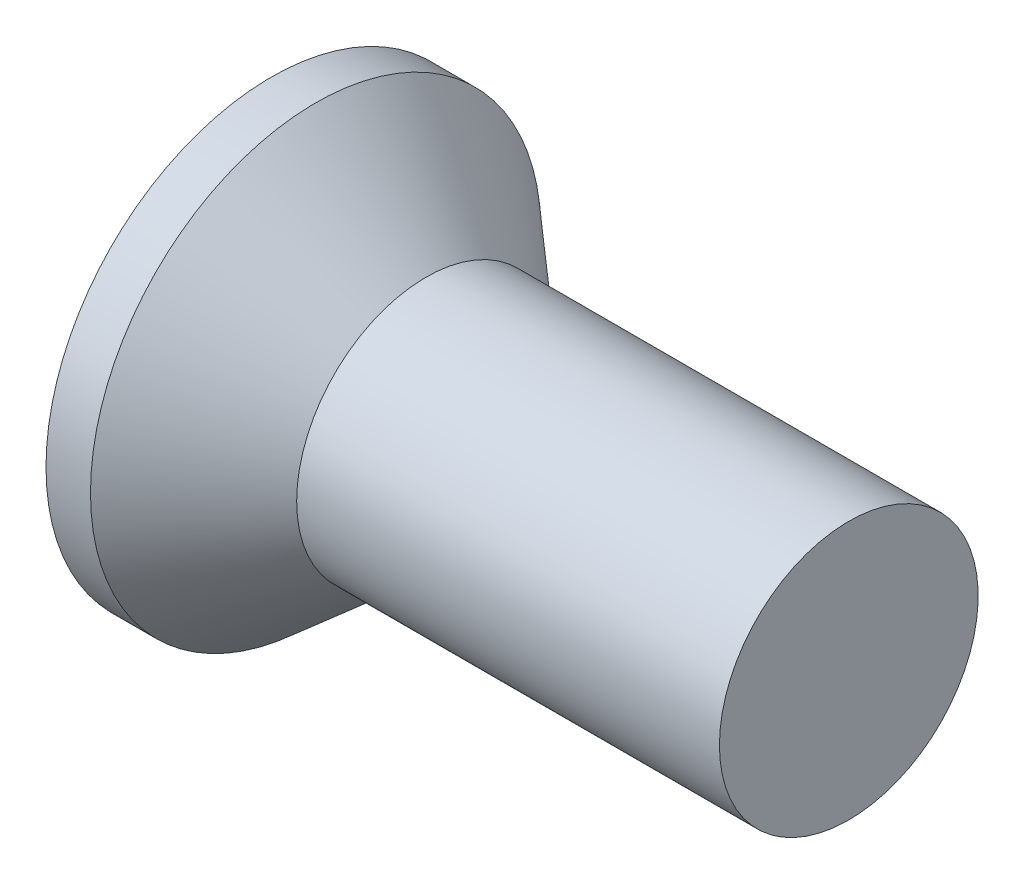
ISO-10303-21;
HEADER;
FILE_DESCRIPTION(('STEP AP214'),'2;1');
FILE_NAME('part.step','',(''),(''),'','','');
FILE_SCHEMA(('AUTOMOTIVE_DESIGN { 1 0 10303 214 1 1 1 1 }'));
ENDSEC;
DATA;
#1=APPLICATION_CONTEXT('core data for automotive mechanical design processes');
#2=APPLICATION_PROTOCOL_DEFINITION('international standard','automotive_design',2000,#1);
#3=PRODUCT_CONTEXT('',#1,'mechanical');
#4=PRODUCT('Part','Part','',(#3));
#5=PRODUCT_RELATED_PRODUCT_CATEGORY('part','',(#4));
#6=PRODUCT_DEFINITION_FORMATION('','',#4);
#7=PRODUCT_DEFINITION_CONTEXT('part definition',#1,'design');
#8=PRODUCT_DEFINITION('design','',#6,#7);
#9=PRODUCT_DEFINITION_SHAPE('','',#8);
#10=(LENGTH_UNIT() NAMED_UNIT(*) SI_UNIT(.MILLI.,.METRE.));
#11=(NAMED_UNIT(*) PLANE_ANGLE_UNIT() SI_UNIT($,.RADIAN.));
#12=(NAMED_UNIT(*) SI_UNIT($,.STERADIAN.) SOLID_ANGLE_UNIT());
#13=UNCERTAINTY_MEASURE_WITH_UNIT(LENGTH_MEASURE(1.E-05),#10,'distance_accuracy_value','');
#14=(GEOMETRIC_REPRESENTATION_CONTEXT(3) GLOBAL_UNCERTAINTY_ASSIGNED_CONTEXT((#13)) GLOBAL_UNIT_ASSIGNED_CONTEXT((#10,
#11,#12)) REPRESENTATION_CONTEXT('',''));
#15=CARTESIAN_POINT('',(0.,0.,0.));
#16=DIRECTION('',(0.,0.,1.));
#17=DIRECTION('',(1.,0.,0.));
#18=AXIS2_PLACEMENT_3D('',#15,#16,#17);
#19=CARTESIAN_POINT('',(0.,0.,0.));
#20=DIRECTION('',(-0.999999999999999,0.,0.));
#21=DIRECTION('',(0.,0.,1.));
#22=AXIS2_PLACEMENT_3D('',#19,#20,#21);
#23=PLANE('',#22);
#24=CARTESIAN_POINT('',(0.,0.,0.));
#25=DIRECTION('',(-0.999999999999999,0.,0.));
#26=DIRECTION('',(0.,0.,1.));
#27=AXIS2_PLACEMENT_3D('',#24,#25,#26);
#28=CIRCLE('',#27,2.4765);
#29=CARTESIAN_POINT('',(0.,0.,2.4765));
#30=VERTEX_POINT('',#29);
#31=EDGE_CURVE('E39',#30,#30,#28,.T.);
#32=ORIENTED_EDGE('',*,*,#31,.T.);
#33=EDGE_LOOP('',(#32));
#34=FACE_BOUND('',#33,.T.);
#35=DIRECTION('',(0.,1.,0.));
#36=VECTOR('',#35,1.);
#37=CARTESIAN_POINT('',(0.,-1.99390000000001,-0.406400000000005));
#38=LINE('',#37,#36);
#39=CARTESIAN_POINT('',(0.,-1.99390000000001,-0.406400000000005));
#40=VERTEX_POINT('',#39);
#41=CARTESIAN_POINT('',(0.,-0.406400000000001,-0.406399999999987));
#42=VERTEX_POINT('',#41);
#43=EDGE_CURVE('E100',#40,#42,#38,.T.);
#44=ORIENTED_EDGE('',*,*,#43,.T.);
#45=DIRECTION('',(0.,0.,-1.));
#46=VECTOR('',#45,1.);
#47=CARTESIAN_POINT('',(0.,-0.406400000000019,1.99389999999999));
#48=LINE('',#47,#46);
#49=CARTESIAN_POINT('',(0.,-0.406399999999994,-1.9939));
#50=VERTEX_POINT('',#49);
#51=EDGE_CURVE('E80',#42,#50,#48,.T.);
#52=ORIENTED_EDGE('',*,*,#51,.T.);
#53=DIRECTION('',(0.,1.,0.));
#54=VECTOR('',#53,1.);
#55=CARTESIAN_POINT('',(0.,-0.406399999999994,-1.9939));
#56=LINE('',#55,#54);
#57=CARTESIAN_POINT('',(0.,0.406400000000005,-1.9939));
#58=VERTEX_POINT('',#57);
#59=EDGE_CURVE('E280',#50,#58,#56,.T.);
#60=ORIENTED_EDGE('',*,*,#59,.T.);
#61=DIRECTION('',(0.,0.,1.));
#62=VECTOR('',#61,1.);
#63=CARTESIAN_POINT('',(0.,0.406400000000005,-1.9939));
#64=LINE('',#63,#62);
#65=CARTESIAN_POINT('',(0.,0.406399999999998,-0.406400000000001));
#66=VERTEX_POINT('',#65);
#67=EDGE_CURVE('E96',#58,#66,#64,.T.);
#68=ORIENTED_EDGE('',*,*,#67,.T.);
#69=CARTESIAN_POINT('',(0.,1.9939,-0.406400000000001));
#70=VERTEX_POINT('',#69);
#71=EDGE_CURVE('E90',#66,#70,#38,.T.);
#72=ORIENTED_EDGE('',*,*,#71,.T.);
#73=DIRECTION('',(0.,0.,1.));
#74=VECTOR('',#73,1.);
#75=CARTESIAN_POINT('',(0.,1.9939,-0.406400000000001));
#76=LINE('',#75,#74);
#77=CARTESIAN_POINT('',(0.,1.99390000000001,0.406399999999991));
#78=VERTEX_POINT('',#77);
#79=EDGE_CURVE('E93',#70,#78,#76,.T.);
#80=ORIENTED_EDGE('',*,*,#79,.T.);
#81=DIRECTION('',(0.,-1.,0.));
#82=VECTOR('',#81,1.);
#83=CARTESIAN_POINT('',(0.,1.99390000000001,0.406399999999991));
#84=LINE('',#83,#82);
#85=CARTESIAN_POINT('',(0.,0.406399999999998,0.406400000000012));
#86=VERTEX_POINT('',#85);
#87=EDGE_CURVE('E292',#78,#86,#84,.T.);
#88=ORIENTED_EDGE('',*,*,#87,.T.);
#89=CARTESIAN_POINT('',(0.,0.40639999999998,1.99390000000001));
#90=VERTEX_POINT('',#89);
#91=EDGE_CURVE('E275',#86,#90,#64,.T.);
#92=ORIENTED_EDGE('',*,*,#91,.T.);
#93=DIRECTION('',(0.,-1.,0.));
#94=VECTOR('',#93,1.);
#95=CARTESIAN_POINT('',(0.,0.40639999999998,1.99390000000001));
#96=LINE('',#95,#94);
#97=CARTESIAN_POINT('',(0.,-0.406400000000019,1.99389999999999));
#98=VERTEX_POINT('',#97);
#99=EDGE_CURVE('E261',#90,#98,#96,.T.);
#100=ORIENTED_EDGE('',*,*,#99,.T.);
#101=CARTESIAN_POINT('',(0.,-0.406400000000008,0.406400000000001));
#102=VERTEX_POINT('',#101);
#103=EDGE_CURVE('E273',#98,#102,#48,.T.);
#104=ORIENTED_EDGE('',*,*,#103,.T.);
#105=CARTESIAN_POINT('',(0.,-1.99390000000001,0.406399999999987));
#106=VERTEX_POINT('',#105);
#107=EDGE_CURVE('E106',#102,#106,#84,.T.);
#108=ORIENTED_EDGE('',*,*,#107,.T.);
#109=DIRECTION('',(0.,0.,-1.));
#110=VECTOR('',#109,1.);
#111=CARTESIAN_POINT('',(0.,-1.99390000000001,0.406399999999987));
#112=LINE('',#111,#110);
#113=EDGE_CURVE('E129',#106,#40,#112,.T.);
#114=ORIENTED_EDGE('',*,*,#113,.T.);
#115=EDGE_LOOP('',(#44,#52,#60,#68,#72,#80,#88,#92,#100,#104,#108,#114));
#116=FACE_BOUND('',#115,.T.);
#117=ADVANCED_FACE('F32',(#34,#116),#23,.T.);
#118=CARTESIAN_POINT('',(2.48883971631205,0.,0.18014184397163));
#119=DIRECTION('',(-0.0905357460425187,0.,-0.995893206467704));
#120=DIRECTION('',(-0.995893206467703,0.,0.0905357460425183));
#121=AXIS2_PLACEMENT_3D('',#118,#119,#120);
#122=PLANE('',#121);
#123=ORIENTED_EDGE('',*,*,#107,.F.);
#124=DIRECTION('',(0.991836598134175,0.0901669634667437,-0.090166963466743));
#125=VECTOR('',#124,1.);
#126=CARTESIAN_POINT('',(2.5049499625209,-0.178677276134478,0.178677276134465));
#127=LINE('',#126,#125);
#128=CARTESIAN_POINT('',(2.2352,-0.203200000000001,0.203199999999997));
#129=VERTEX_POINT('',#128);
#130=EDGE_CURVE('E124',#102,#129,#127,.T.);
#131=ORIENTED_EDGE('',*,*,#130,.T.);
#132=DIRECTION('',(0.778479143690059,0.623667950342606,-0.0707708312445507));
#133=VECTOR('',#132,1.);
#134=CARTESIAN_POINT('',(0.,-1.99390000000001,0.406399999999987));
#135=LINE('',#134,#133);
#136=EDGE_CURVE('E101',#106,#129,#135,.T.);
#137=ORIENTED_EDGE('',*,*,#136,.F.);
#138=EDGE_LOOP('',(#123,#131,#137));
#139=FACE_BOUND('',#138,.T.);
#140=ADVANCED_FACE('F152',(#139),#122,.T.);
#141=DIRECTION('',(0.778479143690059,-0.623667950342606,-0.0707708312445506));
#142=VECTOR('',#141,1.);
#143=CARTESIAN_POINT('',(0.,1.99390000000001,0.406399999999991));
#144=LINE('',#143,#142);
#145=CARTESIAN_POINT('',(2.2352,0.203199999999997,0.203200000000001));
#146=VERTEX_POINT('',#145);
#147=EDGE_CURVE('E46',#78,#146,#144,.T.);
#148=ORIENTED_EDGE('',*,*,#147,.T.);
#149=DIRECTION('',(-0.991836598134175,0.090166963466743,0.090166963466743));
#150=VECTOR('',#149,1.);
#151=CARTESIAN_POINT('',(2.5049499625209,0.178677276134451,0.178677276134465));
#152=LINE('',#151,#150);
#153=EDGE_CURVE('E288',#146,#86,#152,.T.);
#154=ORIENTED_EDGE('',*,*,#153,.T.);
#155=ORIENTED_EDGE('',*,*,#87,.F.);
#156=EDGE_LOOP('',(#148,#154,#155));
#157=FACE_BOUND('',#156,.T.);
#158=ADVANCED_FACE('F156',(#157),#122,.T.);
#159=CARTESIAN_POINT('',(2.48883971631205,0.,-0.18014184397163));
#160=DIRECTION('',(-0.0905357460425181,0.,0.995893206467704));
#161=DIRECTION('',(0.995893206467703,0.,0.0905357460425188));
#162=AXIS2_PLACEMENT_3D('',#159,#160,#161);
#163=PLANE('',#162);
#164=DIRECTION('',(0.778479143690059,0.623667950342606,0.0707708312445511));
#165=VECTOR('',#164,1.);
#166=CARTESIAN_POINT('',(0.,-1.99390000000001,-0.406400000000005));
#167=LINE('',#166,#165);
#168=CARTESIAN_POINT('',(2.2352,-0.203200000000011,-0.203200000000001));
#169=VERTEX_POINT('',#168);
#170=EDGE_CURVE('E55',#40,#169,#167,.T.);
#171=ORIENTED_EDGE('',*,*,#170,.T.);
#172=DIRECTION('',(-0.991836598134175,-0.0901669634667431,-0.0901669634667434));
#173=VECTOR('',#172,1.);
#174=CARTESIAN_POINT('',(2.5049499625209,-0.178677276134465,-0.178677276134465));
#175=LINE('',#174,#173);
#176=EDGE_CURVE('E11',#169,#42,#175,.T.);
#177=ORIENTED_EDGE('',*,*,#176,.T.);
#178=ORIENTED_EDGE('',*,*,#43,.F.);
#179=EDGE_LOOP('',(#171,#177,#178));
#180=FACE_BOUND('',#179,.T.);
#181=ADVANCED_FACE('F149',(#180),#163,.T.);
#182=ORIENTED_EDGE('',*,*,#71,.F.);
#183=DIRECTION('',(0.991836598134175,-0.0901669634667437,0.0901669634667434));
#184=VECTOR('',#183,1.);
#185=CARTESIAN_POINT('',(2.5049499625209,0.178677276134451,-0.178677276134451));
#186=LINE('',#185,#184);
#187=CARTESIAN_POINT('',(2.2352,0.203200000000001,-0.203200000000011));
#188=VERTEX_POINT('',#187);
#189=EDGE_CURVE('E109',#66,#188,#186,.T.);
#190=ORIENTED_EDGE('',*,*,#189,.T.);
#191=DIRECTION('',(0.778479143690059,-0.623667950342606,0.0707708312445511));
#192=VECTOR('',#191,1.);
#193=CARTESIAN_POINT('',(0.,1.9939,-0.406400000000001));
#194=LINE('',#193,#192);
#195=EDGE_CURVE('E105',#70,#188,#194,.T.);
#196=ORIENTED_EDGE('',*,*,#195,.F.);
#197=EDGE_LOOP('',(#182,#190,#196));
#198=FACE_BOUND('',#197,.T.);
#199=ADVANCED_FACE('F108',(#198),#163,.T.);
#200=CARTESIAN_POINT('',(-6.34999999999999,0.,0.));
#201=DIRECTION('',(-0.999999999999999,0.,0.));
#202=DIRECTION('',(0.,0.,1.));
#203=AXIS2_PLACEMENT_3D('',#200,#201,#202);
#204=CYLINDRICAL_SURFACE('',#203,2.4765);
#205=CARTESIAN_POINT('',(0.489196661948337,0.,0.));
#206=DIRECTION('',(-0.999999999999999,0.,0.));
#207=DIRECTION('',(0.,0.,1.));
#208=AXIS2_PLACEMENT_3D('',#205,#206,#207);
#209=CIRCLE('',#208,2.4765);
#210=CARTESIAN_POINT('',(0.489196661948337,0.,2.4765));
#211=VERTEX_POINT('',#210);
#212=EDGE_CURVE('E132',#211,#211,#209,.T.);
#213=CARTESIAN_POINT('',(0.489196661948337,0.,2.4765));
#214=CARTESIAN_POINT('',(0.484100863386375,0.,2.4765));
#215=CARTESIAN_POINT('',(0.479005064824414,0.,2.4765));
#216=CARTESIAN_POINT('',(0.46881346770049,0.,2.4765));
#217=CARTESIAN_POINT('',(0.463717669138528,0.,2.4765));
#218=CARTESIAN_POINT('',(0.453526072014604,0.,2.4765));
#219=CARTESIAN_POINT('',(0.448430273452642,0.,2.4765));
#220=CARTESIAN_POINT('',(0.438238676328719,0.,2.4765));
#221=CARTESIAN_POINT('',(0.433142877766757,0.,2.4765));
#222=CARTESIAN_POINT('',(0.422951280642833,0.,2.4765));
#223=CARTESIAN_POINT('',(0.417855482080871,0.,2.4765));
#224=CARTESIAN_POINT('',(0.407663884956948,0.,2.4765));
#225=CARTESIAN_POINT('',(0.402568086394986,0.,2.4765));
#226=CARTESIAN_POINT('',(0.392376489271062,0.,2.4765));
#227=CARTESIAN_POINT('',(0.3872806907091,0.,2.4765));
#228=CARTESIAN_POINT('',(0.377089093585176,0.,2.4765));
#229=CARTESIAN_POINT('',(0.371993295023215,0.,2.4765));
#230=CARTESIAN_POINT('',(0.361801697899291,0.,2.4765));
#231=CARTESIAN_POINT('',(0.356705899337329,0.,2.4765));
#232=CARTESIAN_POINT('',(0.346514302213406,0.,2.4765));
#233=CARTESIAN_POINT('',(0.341418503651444,0.,2.4765));
#234=CARTESIAN_POINT('',(0.33122690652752,0.,2.4765));
#235=CARTESIAN_POINT('',(0.326131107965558,0.,2.4765));
#236=CARTESIAN_POINT('',(0.315939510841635,0.,2.4765));
#237=CARTESIAN_POINT('',(0.310843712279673,0.,2.4765));
#238=CARTESIAN_POINT('',(0.300652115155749,0.,2.4765));
#239=CARTESIAN_POINT('',(0.295556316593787,0.,2.4765));
#240=CARTESIAN_POINT('',(0.285364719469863,0.,2.4765));
#241=CARTESIAN_POINT('',(0.280268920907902,0.,2.4765));
#242=CARTESIAN_POINT('',(0.270077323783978,0.,2.4765));
#243=CARTESIAN_POINT('',(0.264981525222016,0.,2.4765));
#244=CARTESIAN_POINT('',(0.254789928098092,0.,2.4765));
#245=CARTESIAN_POINT('',(0.24969412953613,0.,2.4765));
#246=CARTESIAN_POINT('',(0.239502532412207,0.,2.4765));
#247=CARTESIAN_POINT('',(0.234406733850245,0.,2.4765));
#248=CARTESIAN_POINT('',(0.224215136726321,0.,2.4765));
#249=CARTESIAN_POINT('',(0.219119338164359,0.,2.4765));
#250=CARTESIAN_POINT('',(0.208927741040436,0.,2.4765));
#251=CARTESIAN_POINT('',(0.203831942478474,0.,2.4765));
#252=CARTESIAN_POINT('',(0.19364034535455,0.,2.4765));
#253=CARTESIAN_POINT('',(0.188544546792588,0.,2.4765));
#254=CARTESIAN_POINT('',(0.178352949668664,0.,2.4765));
#255=CARTESIAN_POINT('',(0.173257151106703,0.,2.4765));
#256=CARTESIAN_POINT('',(0.163065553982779,0.,2.4765));
#257=CARTESIAN_POINT('',(0.157969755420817,0.,2.4765));
#258=CARTESIAN_POINT('',(0.147778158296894,0.,2.4765));
#259=CARTESIAN_POINT('',(0.142682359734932,0.,2.4765));
#260=CARTESIAN_POINT('',(0.132490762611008,0.,2.4765));
#261=CARTESIAN_POINT('',(0.127394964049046,0.,2.4765));
#262=CARTESIAN_POINT('',(0.117203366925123,0.,2.4765));
#263=CARTESIAN_POINT('',(0.112107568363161,0.,2.4765));
#264=CARTESIAN_POINT('',(0.101915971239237,0.,2.4765));
#265=CARTESIAN_POINT('',(0.096820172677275,0.,2.4765));
#266=CARTESIAN_POINT('',(0.0866285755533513,0.,2.4765));
#267=CARTESIAN_POINT('',(0.0815327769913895,0.,2.4765));
#268=CARTESIAN_POINT('',(0.0713411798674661,0.,2.4765));
#269=CARTESIAN_POINT('',(0.0662453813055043,0.,2.4765));
#270=CARTESIAN_POINT('',(0.0560537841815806,0.,2.4765));
#271=CARTESIAN_POINT('',(0.0509579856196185,0.,2.4765));
#272=CARTESIAN_POINT('',(0.0407663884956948,0.,2.4765));
#273=CARTESIAN_POINT('',(0.035670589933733,0.,2.4765));
#274=CARTESIAN_POINT('',(0.0254789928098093,0.,2.4765));
#275=CARTESIAN_POINT('',(0.0203831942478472,0.,2.4765));
#276=CARTESIAN_POINT('',(0.0101915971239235,0.,2.4765));
#277=CARTESIAN_POINT('',(0.00509579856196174,0.,2.4765));
#278=CARTESIAN_POINT('',(0.,0.,2.4765));
#279=B_SPLINE_CURVE_WITH_KNOTS('',3,(#213,#214,#215,#216,#217,#218,#219,#220,#221,#222,#223,
#224,#225,#226,#227,#228,#229,#230,#231,#232,#233,#234,#235,#236,#237,#238,#239,#240,#241,#242,
#243,#244,#245,#246,#247,#248,#249,#250,#251,#252,#253,#254,#255,#256,#257,#258,#259,#260,#261,
#262,#263,#264,#265,#266,#267,#268,#269,#270,#271,#272,#273,#274,#275,#276,#277,#278),
.UNSPECIFIED.,.F.,.F.,(4,2,2,2,2,2,2,2,2,2,2,2,2,2,2,2,2,2,2,2,2,2,2,2,2,2,2,2,2,2,2,2,4),(0.,
0.0152873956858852,0.0305747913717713,0.0458621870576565,0.0611495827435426,0.0764369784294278,
0.091724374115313,0.107011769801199,0.122299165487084,0.13758656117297,0.152873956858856,
0.168161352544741,0.183448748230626,0.198736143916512,0.214023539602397,0.229310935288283,
0.244598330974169,0.259885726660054,0.27517312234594,0.290460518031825,0.305747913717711,
0.321035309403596,0.336322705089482,0.351610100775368,0.366897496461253,0.382184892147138,
0.397472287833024,0.412759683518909,0.428047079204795,0.443334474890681,0.458621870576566,
0.473909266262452,0.489196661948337),.UNSPECIFIED.);
#280=EDGE_CURVE('BSEAM138',#211,#30,#279,.T.);
#281=ORIENTED_EDGE('',*,*,#212,.T.);
#282=ORIENTED_EDGE('',*,*,#31,.F.);
#283=ORIENTED_EDGE('',*,*,#280,.T.);
#284=ORIENTED_EDGE('',*,*,#280,.F.);
#285=EDGE_LOOP('',(#281,#283,#282,#284));
#286=FACE_BOUND('',#285,.T.);
#287=ADVANCED_FACE('F138',(#286),#204,.T.);
#288=CARTESIAN_POINT('',(0.489196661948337,0.,0.));
#289=DIRECTION('',(-0.999999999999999,0.,0.));
#290=DIRECTION('',(0.,0.,1.));
#291=AXIS2_PLACEMENT_3D('',#288,#289,#290);
#292=CONICAL_SURFACE('',#291,2.4765,0.715584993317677);
#293=CARTESIAN_POINT('',(1.7018,0.,0.));
#294=DIRECTION('',(-0.999999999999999,0.,0.));
#295=DIRECTION('',(0.,0.,1.));
#296=AXIS2_PLACEMENT_3D('',#293,#294,#295);
#297=CIRCLE('',#296,1.4224);
#298=CARTESIAN_POINT('',(1.7018,0.,1.4224));
#299=VERTEX_POINT('',#298);
#300=EDGE_CURVE('E128',#299,#299,#297,.T.);
#301=CARTESIAN_POINT('',(1.7018,0.,1.4224));
#302=CARTESIAN_POINT('',(1.68916871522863,0.,1.43338020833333));
#303=CARTESIAN_POINT('',(1.67653743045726,0.,1.44436041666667));
#304=CARTESIAN_POINT('',(1.65127486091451,0.,1.46632083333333));
#305=CARTESIAN_POINT('',(1.63864357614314,0.,1.47730104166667));
#306=CARTESIAN_POINT('',(1.6133810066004,0.,1.49926145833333));
#307=CARTESIAN_POINT('',(1.60074972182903,0.,1.51024166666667));
#308=CARTESIAN_POINT('',(1.57548715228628,0.,1.53220208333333));
#309=CARTESIAN_POINT('',(1.56285586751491,0.,1.54318229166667));
#310=CARTESIAN_POINT('',(1.53759329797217,0.,1.56514270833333));
#311=CARTESIAN_POINT('',(1.5249620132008,0.,1.57612291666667));
#312=CARTESIAN_POINT('',(1.49969944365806,0.,1.59808333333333));
#313=CARTESIAN_POINT('',(1.48706815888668,0.,1.60906354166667));
#314=CARTESIAN_POINT('',(1.46180558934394,0.,1.63102395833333));
#315=CARTESIAN_POINT('',(1.44917430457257,0.,1.64200416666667));
#316=CARTESIAN_POINT('',(1.42391173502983,0.,1.66396458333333));
#317=CARTESIAN_POINT('',(1.41128045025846,0.,1.67494479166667));
#318=CARTESIAN_POINT('',(1.38601788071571,0.,1.69690520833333));
#319=CARTESIAN_POINT('',(1.37338659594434,0.,1.70788541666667));
#320=CARTESIAN_POINT('',(1.3481240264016,0.,1.72984583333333));
#321=CARTESIAN_POINT('',(1.33549274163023,0.,1.74082604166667));
#322=CARTESIAN_POINT('',(1.31023017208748,0.,1.76278645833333));
#323=CARTESIAN_POINT('',(1.29759888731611,0.,1.77376666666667));
#324=CARTESIAN_POINT('',(1.27233631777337,0.,1.79572708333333));
#325=CARTESIAN_POINT('',(1.259705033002,0.,1.80670729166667));
#326=CARTESIAN_POINT('',(1.23444246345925,0.,1.82866770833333));
#327=CARTESIAN_POINT('',(1.22181117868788,0.,1.83964791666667));
#328=CARTESIAN_POINT('',(1.19654860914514,0.,1.86160833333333));
#329=CARTESIAN_POINT('',(1.18391732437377,0.,1.87258854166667));
#330=CARTESIAN_POINT('',(1.15865475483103,0.,1.89454895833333));
#331=CARTESIAN_POINT('',(1.14602347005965,0.,1.90552916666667));
#332=CARTESIAN_POINT('',(1.12076090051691,0.,1.92748958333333));
#333=CARTESIAN_POINT('',(1.10812961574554,0.,1.93846979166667));
#334=CARTESIAN_POINT('',(1.0828670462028,0.,1.96043020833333));
#335=CARTESIAN_POINT('',(1.07023576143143,0.,1.97141041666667));
#336=CARTESIAN_POINT('',(1.04497319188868,0.,1.99337083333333));
#337=CARTESIAN_POINT('',(1.03234190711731,0.,2.00435104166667));
#338=CARTESIAN_POINT('',(1.00707933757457,0.,2.02631145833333));
#339=CARTESIAN_POINT('',(0.994448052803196,0.,2.03729166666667));
#340=CARTESIAN_POINT('',(0.969185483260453,0.,2.05925208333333));
#341=CARTESIAN_POINT('',(0.956554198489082,0.,2.07023229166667));
#342=CARTESIAN_POINT('',(0.931291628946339,0.,2.09219270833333));
#343=CARTESIAN_POINT('',(0.918660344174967,0.,2.10317291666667));
#344=CARTESIAN_POINT('',(0.893397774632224,0.,2.12513333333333));
#345=CARTESIAN_POINT('',(0.880766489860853,0.,2.13611354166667));
#346=CARTESIAN_POINT('',(0.85550392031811,0.,2.15807395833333));
#347=CARTESIAN_POINT('',(0.842872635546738,0.,2.16905416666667));
#348=CARTESIAN_POINT('',(0.817610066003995,0.,2.19101458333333));
#349=CARTESIAN_POINT('',(0.804978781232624,0.,2.20199479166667));
#350=CARTESIAN_POINT('',(0.779716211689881,0.,2.22395520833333));
#351=CARTESIAN_POINT('',(0.767084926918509,0.,2.23493541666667));
#352=CARTESIAN_POINT('',(0.741822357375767,0.,2.25689583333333));
#353=CARTESIAN_POINT('',(0.729191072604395,0.,2.26787604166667));
#354=CARTESIAN_POINT('',(0.703928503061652,0.,2.28983645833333));
#355=CARTESIAN_POINT('',(0.69129721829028,0.,2.30081666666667));
#356=CARTESIAN_POINT('',(0.666034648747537,0.,2.32277708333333));
#357=CARTESIAN_POINT('',(0.653403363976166,0.,2.33375729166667));
#358=CARTESIAN_POINT('',(0.628140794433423,0.,2.35571770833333));
#359=CARTESIAN_POINT('',(0.615509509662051,0.,2.36669791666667));
#360=CARTESIAN_POINT('',(0.590246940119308,0.,2.38865833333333));
#361=CARTESIAN_POINT('',(0.577615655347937,0.,2.39963854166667));
#362=CARTESIAN_POINT('',(0.552353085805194,0.,2.42159895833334));
#363=CARTESIAN_POINT('',(0.539721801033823,0.,2.43257916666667));
#364=CARTESIAN_POINT('',(0.51445923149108,0.,2.45453958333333));
#365=CARTESIAN_POINT('',(0.501827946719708,0.,2.46551979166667));
#366=CARTESIAN_POINT('',(0.489196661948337,0.,2.4765));
#367=B_SPLINE_CURVE_WITH_KNOTS('',3,(#301,#302,#303,#304,#305,#306,#307,#308,#309,#310,#311,
#312,#313,#314,#315,#316,#317,#318,#319,#320,#321,#322,#323,#324,#325,#326,#327,#328,#329,#330,
#331,#332,#333,#334,#335,#336,#337,#338,#339,#340,#341,#342,#343,#344,#345,#346,#347,#348,#349,
#350,#351,#352,#353,#354,#355,#356,#357,#358,#359,#360,#361,#362,#363,#364,#365,#366),
.UNSPECIFIED.,.F.,.F.,(4,2,2,2,2,2,2,2,2,2,2,2,2,2,2,2,2,2,2,2,2,2,2,2,2,2,2,2,2,2,2,2,4),(0.,
0.0502098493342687,0.100419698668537,0.150629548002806,0.200839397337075,0.251049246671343,
0.301259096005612,0.351468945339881,0.40167879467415,0.451888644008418,0.502098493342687,
0.552308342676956,0.602518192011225,0.652728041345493,0.702937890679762,0.753147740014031,
0.803357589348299,0.853567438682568,0.903777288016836,0.953987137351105,1.00419698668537,
1.05440683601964,1.10461668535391,1.15482653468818,1.20503638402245,1.25524623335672,
1.30545608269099,1.35566593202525,1.40587578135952,1.45608563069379,1.50629548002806,
1.55650532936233,1.6067151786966),.UNSPECIFIED.);
#368=EDGE_CURVE('BSEAM140',#299,#211,#367,.T.);
#369=ORIENTED_EDGE('',*,*,#300,.T.);
#370=ORIENTED_EDGE('',*,*,#212,.F.);
#371=ORIENTED_EDGE('',*,*,#368,.T.);
#372=ORIENTED_EDGE('',*,*,#368,.F.);
#373=EDGE_LOOP('',(#369,#371,#370,#372));
#374=FACE_BOUND('',#373,.T.);
#375=ADVANCED_FACE('F140',(#374),#292,.T.);
#376=CARTESIAN_POINT('',(-6.34999999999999,0.,0.));
#377=DIRECTION('',(-0.999999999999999,0.,0.));
#378=DIRECTION('',(0.,0.,1.));
#379=AXIS2_PLACEMENT_3D('',#376,#377,#378);
#380=CYLINDRICAL_SURFACE('',#379,1.4224);
#381=CARTESIAN_POINT('',(6.34999999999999,0.,0.));
#382=DIRECTION('',(-0.999999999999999,0.,0.));
#383=DIRECTION('',(0.,0.,1.));
#384=AXIS2_PLACEMENT_3D('',#381,#382,#383);
#385=CIRCLE('',#384,1.4224);
#386=CARTESIAN_POINT('',(6.34999999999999,0.,1.4224));
#387=VERTEX_POINT('',#386);
#388=EDGE_CURVE('E125',#387,#387,#385,.T.);
#389=CARTESIAN_POINT('',(6.34999999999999,0.,1.4224));
#390=CARTESIAN_POINT('',(6.30158124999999,0.,1.4224));
#391=CARTESIAN_POINT('',(6.25316249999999,0.,1.4224));
#392=CARTESIAN_POINT('',(6.15632499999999,0.,1.4224));
#393=CARTESIAN_POINT('',(6.10790624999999,0.,1.4224));
#394=CARTESIAN_POINT('',(6.01106874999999,0.,1.4224));
#395=CARTESIAN_POINT('',(5.96264999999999,0.,1.4224));
#396=CARTESIAN_POINT('',(5.86581249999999,0.,1.4224));
#397=CARTESIAN_POINT('',(5.81739374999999,0.,1.4224));
#398=CARTESIAN_POINT('',(5.72055624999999,0.,1.4224));
#399=CARTESIAN_POINT('',(5.67213749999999,0.,1.4224));
#400=CARTESIAN_POINT('',(5.57529999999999,0.,1.4224));
#401=CARTESIAN_POINT('',(5.52688124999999,0.,1.4224));
#402=CARTESIAN_POINT('',(5.43004374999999,0.,1.4224));
#403=CARTESIAN_POINT('',(5.38162499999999,0.,1.4224));
#404=CARTESIAN_POINT('',(5.28478749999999,0.,1.4224));
#405=CARTESIAN_POINT('',(5.23636874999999,0.,1.4224));
#406=CARTESIAN_POINT('',(5.13953124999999,0.,1.4224));
#407=CARTESIAN_POINT('',(5.09111249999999,0.,1.4224));
#408=CARTESIAN_POINT('',(4.99427499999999,0.,1.4224));
#409=CARTESIAN_POINT('',(4.94585624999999,0.,1.4224));
#410=CARTESIAN_POINT('',(4.84901874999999,0.,1.4224));
#411=CARTESIAN_POINT('',(4.80059999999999,0.,1.4224));
#412=CARTESIAN_POINT('',(4.70376249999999,0.,1.4224));
#413=CARTESIAN_POINT('',(4.65534374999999,0.,1.4224));
#414=CARTESIAN_POINT('',(4.55850624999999,0.,1.4224));
#415=CARTESIAN_POINT('',(4.51008749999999,0.,1.4224));
#416=CARTESIAN_POINT('',(4.41324999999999,0.,1.4224));
#417=CARTESIAN_POINT('',(4.36483124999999,0.,1.4224));
#418=CARTESIAN_POINT('',(4.26799374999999,0.,1.4224));
#419=CARTESIAN_POINT('',(4.21957499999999,0.,1.4224));
#420=CARTESIAN_POINT('',(4.12273749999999,0.,1.4224));
#421=CARTESIAN_POINT('',(4.07431874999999,0.,1.4224));
#422=CARTESIAN_POINT('',(3.97748124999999,0.,1.4224));
#423=CARTESIAN_POINT('',(3.92906249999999,0.,1.4224));
#424=CARTESIAN_POINT('',(3.83222499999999,0.,1.4224));
#425=CARTESIAN_POINT('',(3.78380624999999,0.,1.4224));
#426=CARTESIAN_POINT('',(3.68696874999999,0.,1.4224));
#427=CARTESIAN_POINT('',(3.63854999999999,0.,1.4224));
#428=CARTESIAN_POINT('',(3.54171249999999,0.,1.4224));
#429=CARTESIAN_POINT('',(3.49329374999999,0.,1.4224));
#430=CARTESIAN_POINT('',(3.39645625,0.,1.4224));
#431=CARTESIAN_POINT('',(3.34803749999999,0.,1.4224));
#432=CARTESIAN_POINT('',(3.2512,0.,1.4224));
#433=CARTESIAN_POINT('',(3.20278125,0.,1.4224));
#434=CARTESIAN_POINT('',(3.10594375,0.,1.4224));
#435=CARTESIAN_POINT('',(3.057525,0.,1.4224));
#436=CARTESIAN_POINT('',(2.9606875,0.,1.4224));
#437=CARTESIAN_POINT('',(2.91226875,0.,1.4224));
#438=CARTESIAN_POINT('',(2.81543125,0.,1.4224));
#439=CARTESIAN_POINT('',(2.7670125,0.,1.4224));
#440=CARTESIAN_POINT('',(2.670175,0.,1.4224));
#441=CARTESIAN_POINT('',(2.62175625,0.,1.4224));
#442=CARTESIAN_POINT('',(2.52491875,0.,1.4224));
#443=CARTESIAN_POINT('',(2.4765,0.,1.4224));
#444=CARTESIAN_POINT('',(2.3796625,0.,1.4224));
#445=CARTESIAN_POINT('',(2.33124375,0.,1.4224));
#446=CARTESIAN_POINT('',(2.23440625,0.,1.4224));
#447=CARTESIAN_POINT('',(2.1859875,0.,1.4224));
#448=CARTESIAN_POINT('',(2.08915,0.,1.4224));
#449=CARTESIAN_POINT('',(2.04073125,0.,1.4224));
#450=CARTESIAN_POINT('',(1.94389375,0.,1.4224));
#451=CARTESIAN_POINT('',(1.895475,0.,1.4224));
#452=CARTESIAN_POINT('',(1.7986375,0.,1.4224));
#453=CARTESIAN_POINT('',(1.75021875,0.,1.4224));
#454=CARTESIAN_POINT('',(1.7018,0.,1.4224));
#455=B_SPLINE_CURVE_WITH_KNOTS('',3,(#389,#390,#391,#392,#393,#394,#395,#396,#397,#398,#399,
#400,#401,#402,#403,#404,#405,#406,#407,#408,#409,#410,#411,#412,#413,#414,#415,#416,#417,#418,
#419,#420,#421,#422,#423,#424,#425,#426,#427,#428,#429,#430,#431,#432,#433,#434,#435,#436,#437,
#438,#439,#440,#441,#442,#443,#444,#445,#446,#447,#448,#449,#450,#451,#452,#453,#454),
.UNSPECIFIED.,.F.,.F.,(4,2,2,2,2,2,2,2,2,2,2,2,2,2,2,2,2,2,2,2,2,2,2,2,2,2,2,2,2,2,2,2,4),(0.,
0.145256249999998,0.290512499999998,0.435768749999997,0.581024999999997,0.726281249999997,
0.871537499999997,1.01679375,1.16205,1.30730625,1.4525625,1.59781875,1.743075,1.88833124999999,
2.03358749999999,2.17884374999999,2.32409999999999,2.46935624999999,2.61461249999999,
2.75986874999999,2.90512499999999,3.05038124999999,3.19563749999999,3.34089374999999,
3.48614999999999,3.63140624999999,3.77666249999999,3.92191874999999,4.06717499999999,
4.21243124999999,4.35768749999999,4.50294374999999,4.64819999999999),.UNSPECIFIED.);
#456=EDGE_CURVE('BSEAM146',#387,#299,#455,.T.);
#457=ORIENTED_EDGE('',*,*,#388,.T.);
#458=ORIENTED_EDGE('',*,*,#300,.F.);
#459=ORIENTED_EDGE('',*,*,#456,.T.);
#460=ORIENTED_EDGE('',*,*,#456,.F.);
#461=EDGE_LOOP('',(#457,#459,#458,#460));
#462=FACE_BOUND('',#461,.T.);
#463=ADVANCED_FACE('F146',(#462),#380,.T.);
#464=CARTESIAN_POINT('',(6.34999999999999,1.42239999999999,0.));
#465=DIRECTION('',(0.999999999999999,0.,0.));
#466=DIRECTION('',(0.,0.,-1.));
#467=AXIS2_PLACEMENT_3D('',#464,#465,#466);
#468=PLANE('',#467);
#469=ORIENTED_EDGE('',*,*,#388,.F.);
#470=EDGE_LOOP('',(#469));
#471=FACE_BOUND('',#470,.T.);
#472=ADVANCED_FACE('F176',(#471),#468,.T.);
#473=CARTESIAN_POINT('',(2.2352,0.203200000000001,-0.203200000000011));
#474=DIRECTION('',(0.999999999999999,0.,0.));
#475=DIRECTION('',(0.,0.,-1.));
#476=AXIS2_PLACEMENT_3D('',#473,#474,#475);
#477=PLANE('',#476);
#478=DIRECTION('',(0.,1.,0.));
#479=VECTOR('',#478,1.);
#480=CARTESIAN_POINT('',(2.2352,-0.203200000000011,-0.203200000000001));
#481=LINE('',#480,#479);
#482=EDGE_CURVE('E120',#169,#188,#481,.T.);
#483=ORIENTED_EDGE('',*,*,#482,.F.);
#484=DIRECTION('',(0.,0.,-1.));
#485=VECTOR('',#484,1.);
#486=CARTESIAN_POINT('',(2.2352,-0.203200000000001,0.203199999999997));
#487=LINE('',#486,#485);
#488=EDGE_CURVE('E111',#129,#169,#487,.T.);
#489=ORIENTED_EDGE('',*,*,#488,.F.);
#490=DIRECTION('',(0.,-1.,0.));
#491=VECTOR('',#490,1.);
#492=CARTESIAN_POINT('',(2.2352,0.203199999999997,0.203200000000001));
#493=LINE('',#492,#491);
#494=EDGE_CURVE('E114',#146,#129,#493,.T.);
#495=ORIENTED_EDGE('',*,*,#494,.F.);
#496=DIRECTION('',(0.,0.,1.));
#497=VECTOR('',#496,1.);
#498=CARTESIAN_POINT('',(2.2352,0.203200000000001,-0.203200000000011));
#499=LINE('',#498,#497);
#500=EDGE_CURVE('E118',#188,#146,#499,.T.);
#501=ORIENTED_EDGE('',*,*,#500,.F.);
#502=EDGE_LOOP('',(#483,#489,#495,#501));
#503=FACE_BOUND('',#502,.T.);
#504=ADVANCED_FACE('F173',(#503),#477,.F.);
#505=CARTESIAN_POINT('',(0.,-1.99390000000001,-0.406400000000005));
#506=DIRECTION('',(-0.625235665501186,0.780436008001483,0.));
#507=DIRECTION('',(-0.78043600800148,-0.625235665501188,0.));
#508=AXIS2_PLACEMENT_3D('',#505,#506,#507);
#509=PLANE('',#508);
#510=ORIENTED_EDGE('',*,*,#170,.F.);
#511=ORIENTED_EDGE('',*,*,#113,.F.);
#512=ORIENTED_EDGE('',*,*,#136,.T.);
#513=ORIENTED_EDGE('',*,*,#488,.T.);
#514=EDGE_LOOP('',(#510,#511,#512,#513));
#515=FACE_BOUND('',#514,.T.);
#516=ADVANCED_FACE('F165',(#515),#509,.T.);
#517=CARTESIAN_POINT('',(2.2352,0.203199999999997,0.203200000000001));
#518=DIRECTION('',(-0.625235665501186,-0.780436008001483,0.));
#519=DIRECTION('',(0.78043600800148,-0.625235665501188,0.));
#520=AXIS2_PLACEMENT_3D('',#517,#518,#519);
#521=PLANE('',#520);
#522=ORIENTED_EDGE('',*,*,#147,.F.);
#523=ORIENTED_EDGE('',*,*,#79,.F.);
#524=ORIENTED_EDGE('',*,*,#195,.T.);
#525=ORIENTED_EDGE('',*,*,#500,.T.);
#526=EDGE_LOOP('',(#522,#523,#524,#525));
#527=FACE_BOUND('',#526,.T.);
#528=ADVANCED_FACE('F104',(#527),#521,.T.);
#529=CARTESIAN_POINT('',(2.48883971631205,-0.18014184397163,0.));
#530=DIRECTION('',(-0.0905357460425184,0.995893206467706,0.));
#531=DIRECTION('',(-0.995893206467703,-0.0905357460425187,0.));
#532=AXIS2_PLACEMENT_3D('',#529,#530,#531);
#533=PLANE('',#532);
#534=DIRECTION('',(0.778479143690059,0.070770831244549,0.623667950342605));
#535=VECTOR('',#534,1.);
#536=CARTESIAN_POINT('',(0.,-0.406399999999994,-1.9939));
#537=LINE('',#536,#535);
#538=EDGE_CURVE('E282',#50,#169,#537,.T.);
#539=ORIENTED_EDGE('',*,*,#538,.F.);
#540=ORIENTED_EDGE('',*,*,#51,.F.);
#541=ORIENTED_EDGE('',*,*,#176,.F.);
#542=EDGE_LOOP('',(#539,#540,#541));
#543=FACE_BOUND('',#542,.T.);
#544=ADVANCED_FACE('F172',(#543),#533,.T.);
#545=CARTESIAN_POINT('',(2.48883971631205,0.18014184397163,0.));
#546=DIRECTION('',(-0.0905357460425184,-0.995893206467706,0.));
#547=DIRECTION('',(0.995893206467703,-0.0905357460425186,0.));
#548=AXIS2_PLACEMENT_3D('',#545,#546,#547);
#549=PLANE('',#548);
#550=ORIENTED_EDGE('',*,*,#67,.F.);
#551=DIRECTION('',(0.778479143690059,-0.0707708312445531,0.623667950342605));
#552=VECTOR('',#551,1.);
#553=CARTESIAN_POINT('',(0.,0.406400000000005,-1.9939));
#554=LINE('',#553,#552);
#555=EDGE_CURVE('E71',#58,#188,#554,.T.);
#556=ORIENTED_EDGE('',*,*,#555,.T.);
#557=ORIENTED_EDGE('',*,*,#189,.F.);
#558=EDGE_LOOP('',(#550,#556,#557));
#559=FACE_BOUND('',#558,.T.);
#560=ADVANCED_FACE('F216',(#559),#549,.T.);
#561=CARTESIAN_POINT('',(0.,0.406400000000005,-1.9939));
#562=DIRECTION('',(-0.625235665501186,0.,0.780436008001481));
#563=DIRECTION('',(-0.78043600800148,0.,-0.625235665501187));
#564=AXIS2_PLACEMENT_3D('',#561,#562,#563);
#565=PLANE('',#564);
#566=ORIENTED_EDGE('',*,*,#555,.F.);
#567=ORIENTED_EDGE('',*,*,#59,.F.);
#568=ORIENTED_EDGE('',*,*,#538,.T.);
#569=ORIENTED_EDGE('',*,*,#482,.T.);
#570=EDGE_LOOP('',(#566,#567,#568,#569));
#571=FACE_BOUND('',#570,.T.);
#572=ADVANCED_FACE('F224',(#571),#565,.T.);
#573=ORIENTED_EDGE('',*,*,#103,.F.);
#574=DIRECTION('',(0.778479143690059,0.0707708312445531,-0.623667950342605));
#575=VECTOR('',#574,1.);
#576=CARTESIAN_POINT('',(0.,-0.406400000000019,1.99389999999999));
#577=LINE('',#576,#575);
#578=EDGE_CURVE('E258',#98,#129,#577,.T.);
#579=ORIENTED_EDGE('',*,*,#578,.T.);
#580=ORIENTED_EDGE('',*,*,#130,.F.);
#581=EDGE_LOOP('',(#573,#579,#580));
#582=FACE_BOUND('',#581,.T.);
#583=ADVANCED_FACE('F218',(#582),#533,.T.);
#584=DIRECTION('',(0.778479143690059,-0.0707708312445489,-0.623667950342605));
#585=VECTOR('',#584,1.);
#586=CARTESIAN_POINT('',(0.,0.40639999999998,1.99390000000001));
#587=LINE('',#586,#585);
#588=EDGE_CURVE('E269',#90,#146,#587,.T.);
#589=ORIENTED_EDGE('',*,*,#588,.F.);
#590=ORIENTED_EDGE('',*,*,#91,.F.);
#591=ORIENTED_EDGE('',*,*,#153,.F.);
#592=EDGE_LOOP('',(#589,#590,#591));
#593=FACE_BOUND('',#592,.T.);
#594=ADVANCED_FACE('F226',(#593),#549,.T.);
#595=CARTESIAN_POINT('',(2.2352,-0.203200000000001,0.203199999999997));
#596=DIRECTION('',(-0.625235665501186,0.,-0.780436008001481));
#597=DIRECTION('',(0.78043600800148,0.,-0.625235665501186));
#598=AXIS2_PLACEMENT_3D('',#595,#596,#597);
#599=PLANE('',#598);
#600=ORIENTED_EDGE('',*,*,#578,.F.);
#601=ORIENTED_EDGE('',*,*,#99,.F.);
#602=ORIENTED_EDGE('',*,*,#588,.T.);
#603=ORIENTED_EDGE('',*,*,#494,.T.);
#604=EDGE_LOOP('',(#600,#601,#602,#603));
#605=FACE_BOUND('',#604,.T.);
#606=ADVANCED_FACE('F245',(#605),#599,.T.);
#607=CLOSED_SHELL('',(#117,#140,#158,#181,#199,#287,#375,#463,#472,#504,#516,#528,#544,#560,
#572,#583,#594,#606));
#608=MANIFOLD_SOLID_BREP('B2',#607);
#609=ADVANCED_BREP_SHAPE_REPRESENTATION('',(#18,#608),#14);
#610=SHAPE_DEFINITION_REPRESENTATION(#9,#609);
ENDSEC;
END-ISO-10303-21;
